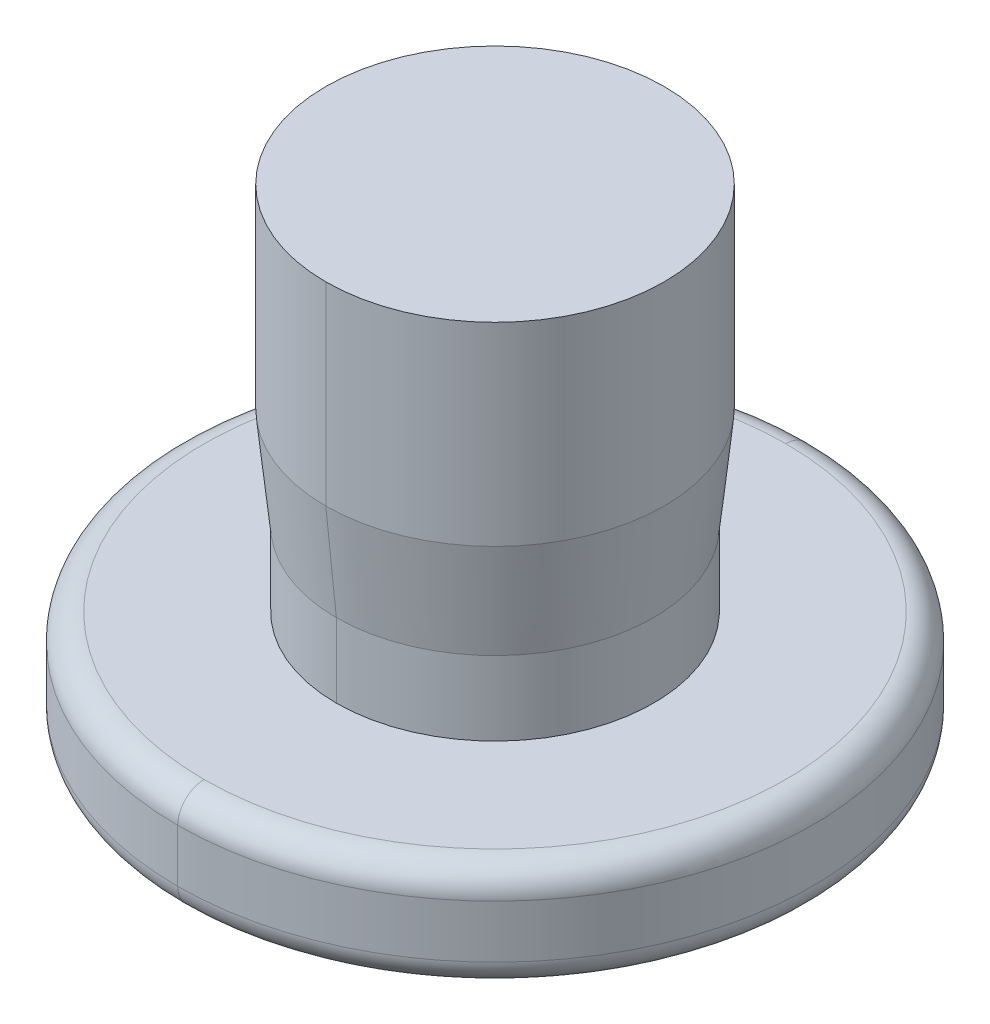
ISO-10303-21;
HEADER;
FILE_DESCRIPTION(('STEP AP214'),'2;1');
FILE_NAME('part.step','',(''),(''),'','','');
FILE_SCHEMA(('AUTOMOTIVE_DESIGN { 1 0 10303 214 1 1 1 1 }'));
ENDSEC;
DATA;
#1=APPLICATION_CONTEXT('core data for automotive mechanical design processes');
#2=APPLICATION_PROTOCOL_DEFINITION('international standard','automotive_design',2000,#1);
#3=PRODUCT_CONTEXT('',#1,'mechanical');
#4=PRODUCT('Part','Part','',(#3));
#5=PRODUCT_RELATED_PRODUCT_CATEGORY('part','',(#4));
#6=PRODUCT_DEFINITION_FORMATION('','',#4);
#7=PRODUCT_DEFINITION_CONTEXT('part definition',#1,'design');
#8=PRODUCT_DEFINITION('design','',#6,#7);
#9=PRODUCT_DEFINITION_SHAPE('','',#8);
#10=(LENGTH_UNIT() NAMED_UNIT(*) SI_UNIT(.MILLI.,.METRE.));
#11=(NAMED_UNIT(*) PLANE_ANGLE_UNIT() SI_UNIT($,.RADIAN.));
#12=(NAMED_UNIT(*) SI_UNIT($,.STERADIAN.) SOLID_ANGLE_UNIT());
#13=UNCERTAINTY_MEASURE_WITH_UNIT(LENGTH_MEASURE(1.E-05),#10,'distance_accuracy_value','');
#14=(GEOMETRIC_REPRESENTATION_CONTEXT(3) GLOBAL_UNCERTAINTY_ASSIGNED_CONTEXT((#13)) GLOBAL_UNIT_ASSIGNED_CONTEXT((#10,
#11,#12)) REPRESENTATION_CONTEXT('',''));
#15=CARTESIAN_POINT('',(0.,0.,0.));
#16=DIRECTION('',(0.,0.,1.));
#17=DIRECTION('',(1.,0.,0.));
#18=AXIS2_PLACEMENT_3D('',#15,#16,#17);
#19=CARTESIAN_POINT('',(36.4639094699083,-12.7939015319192,0.));
#20=DIRECTION('',(0.,-1.,0.));
#21=DIRECTION('',(0.,0.,-1.));
#22=AXIS2_PLACEMENT_3D('',#19,#20,#21);
#23=PLANE('',#22);
#24=CARTESIAN_POINT('',(36.4639094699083,-12.7939015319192,0.));
#25=DIRECTION('',(0.,-1.,0.));
#26=DIRECTION('',(0.,0.,-1.));
#27=AXIS2_PLACEMENT_3D('',#24,#25,#26);
#28=CIRCLE('',#27,1.);
#29=CARTESIAN_POINT('',(36.4639094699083,-12.7939015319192,-1.));
#30=VERTEX_POINT('',#29);
#31=CARTESIAN_POINT('',(36.4639094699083,-12.7939015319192,1.));
#32=VERTEX_POINT('',#31);
#33=EDGE_CURVE('E10',#30,#32,#28,.T.);
#34=ORIENTED_EDGE('',*,*,#33,.T.);
#35=CARTESIAN_POINT('',(36.4639094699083,-12.7939015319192,0.));
#36=DIRECTION('',(0.,-1.,0.));
#37=DIRECTION('',(0.,0.,-1.));
#38=AXIS2_PLACEMENT_3D('',#35,#36,#37);
#39=CIRCLE('',#38,1.);
#40=EDGE_CURVE('E112',#32,#30,#39,.T.);
#41=ORIENTED_EDGE('',*,*,#40,.T.);
#42=EDGE_LOOP('',(#34,#41));
#43=FACE_BOUND('',#42,.T.);
#44=ADVANCED_FACE('F15',(#43),#23,.T.);
#45=CARTESIAN_POINT('',(36.4639094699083,-12.7939015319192,0.));
#46=DIRECTION('',(0.,-1.,0.));
#47=DIRECTION('',(0.,0.,-1.));
#48=AXIS2_PLACEMENT_3D('',#45,#46,#47);
#49=CYLINDRICAL_SURFACE('',#48,1.);
#50=DIRECTION('',(0.,-1.,0.));
#51=VECTOR('',#50,1.);
#52=CARTESIAN_POINT('',(36.4639094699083,-12.7939015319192,1.));
#53=LINE('',#52,#51);
#54=CARTESIAN_POINT('',(36.4639094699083,-13.7939015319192,1.));
#55=VERTEX_POINT('',#54);
#56=EDGE_CURVE('E117',#32,#55,#53,.T.);
#57=ORIENTED_EDGE('',*,*,#56,.F.);
#58=ORIENTED_EDGE('',*,*,#33,.F.);
#59=DIRECTION('',(0.,-1.,0.));
#60=VECTOR('',#59,1.);
#61=CARTESIAN_POINT('',(36.4639094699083,-12.7939015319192,-1.));
#62=LINE('',#61,#60);
#63=CARTESIAN_POINT('',(36.4639094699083,-13.7939015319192,-1.));
#64=VERTEX_POINT('',#63);
#65=EDGE_CURVE('E127',#30,#64,#62,.T.);
#66=ORIENTED_EDGE('',*,*,#65,.T.);
#67=CARTESIAN_POINT('',(36.4639094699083,-13.7939015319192,0.));
#68=DIRECTION('',(0.,-1.,0.));
#69=DIRECTION('',(0.,0.,-1.));
#70=AXIS2_PLACEMENT_3D('',#67,#68,#69);
#71=CIRCLE('',#70,1.);
#72=EDGE_CURVE('E119',#64,#55,#71,.T.);
#73=ORIENTED_EDGE('',*,*,#72,.T.);
#74=EDGE_LOOP('',(#57,#58,#66,#73));
#75=FACE_BOUND('',#74,.T.);
#76=ADVANCED_FACE('F118',(#75),#49,.F.);
#77=CARTESIAN_POINT('',(36.4639094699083,-13.0439015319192,0.));
#78=DIRECTION('',(0.,1.,0.));
#79=DIRECTION('',(0.,0.,1.));
#80=AXIS2_PLACEMENT_3D('',#77,#78,#79);
#81=TOROIDAL_SURFACE('',#80,2.75,0.25);
#82=CARTESIAN_POINT('',(36.4639094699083,-13.0439015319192,-2.75));
#83=DIRECTION('',(1.,0.,0.));
#84=DIRECTION('',(0.,0.,-1.));
#85=AXIS2_PLACEMENT_3D('',#82,#83,#84);
#86=CIRCLE('',#85,0.25);
#87=CARTESIAN_POINT('',(36.4639094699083,-13.0439015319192,-3.));
#88=VERTEX_POINT('',#87);
#89=CARTESIAN_POINT('',(36.4639094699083,-12.7939015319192,-2.75));
#90=VERTEX_POINT('',#89);
#91=EDGE_CURVE('E153',#88,#90,#86,.T.);
#92=ORIENTED_EDGE('',*,*,#91,.F.);
#93=CARTESIAN_POINT('',(36.4639094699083,-13.0439015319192,0.));
#94=DIRECTION('',(0.,-1.,0.));
#95=DIRECTION('',(0.,0.,1.));
#96=AXIS2_PLACEMENT_3D('',#93,#94,#95);
#97=CIRCLE('',#96,3.);
#98=CARTESIAN_POINT('',(36.4639094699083,-13.0439015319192,3.));
#99=VERTEX_POINT('',#98);
#100=EDGE_CURVE('E222',#99,#88,#97,.T.);
#101=ORIENTED_EDGE('',*,*,#100,.F.);
#102=CARTESIAN_POINT('',(36.4639094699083,-13.0439015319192,2.75));
#103=DIRECTION('',(-1.,0.,0.));
#104=DIRECTION('',(0.,-1.,0.));
#105=AXIS2_PLACEMENT_3D('',#102,#103,#104);
#106=CIRCLE('',#105,0.25);
#107=CARTESIAN_POINT('',(36.4639094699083,-12.7939015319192,2.75));
#108=VERTEX_POINT('',#107);
#109=EDGE_CURVE('E167',#99,#108,#106,.T.);
#110=ORIENTED_EDGE('',*,*,#109,.T.);
#111=CARTESIAN_POINT('',(36.4639094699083,-12.7939015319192,0.));
#112=DIRECTION('',(0.,1.,0.));
#113=DIRECTION('',(0.,0.,1.));
#114=AXIS2_PLACEMENT_3D('',#111,#112,#113);
#115=CIRCLE('',#114,2.75);
#116=EDGE_CURVE('E228',#90,#108,#115,.T.);
#117=ORIENTED_EDGE('',*,*,#116,.F.);
#118=EDGE_LOOP('',(#92,#101,#110,#117));
#119=FACE_BOUND('',#118,.T.);
#120=ADVANCED_FACE('F255',(#119),#81,.T.);
#121=CARTESIAN_POINT('',(36.4639094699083,-13.5439015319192,0.));
#122=DIRECTION('',(0.,-1.,0.));
#123=DIRECTION('',(0.,0.,-1.));
#124=AXIS2_PLACEMENT_3D('',#121,#122,#123);
#125=TOROIDAL_SURFACE('',#124,2.75,0.25);
#126=CARTESIAN_POINT('',(36.4639094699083,-13.5439015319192,2.75));
#127=DIRECTION('',(1.,0.,0.));
#128=DIRECTION('',(0.,0.,-1.));
#129=AXIS2_PLACEMENT_3D('',#126,#127,#128);
#130=CIRCLE('',#129,0.25);
#131=CARTESIAN_POINT('',(36.4639094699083,-13.5439015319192,3.));
#132=VERTEX_POINT('',#131);
#133=CARTESIAN_POINT('',(36.4639094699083,-13.7939015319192,2.75));
#134=VERTEX_POINT('',#133);
#135=EDGE_CURVE('E131',#132,#134,#130,.T.);
#136=ORIENTED_EDGE('',*,*,#135,.F.);
#137=CARTESIAN_POINT('',(36.4639094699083,-13.5439015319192,0.));
#138=DIRECTION('',(0.,1.,0.));
#139=DIRECTION('',(0.,0.,-1.));
#140=AXIS2_PLACEMENT_3D('',#137,#138,#139);
#141=CIRCLE('',#140,3.);
#142=CARTESIAN_POINT('',(36.4639094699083,-13.5439015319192,-3.));
#143=VERTEX_POINT('',#142);
#144=EDGE_CURVE('E225',#143,#132,#141,.T.);
#145=ORIENTED_EDGE('',*,*,#144,.F.);
#146=CARTESIAN_POINT('',(36.4639094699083,-13.5439015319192,-2.75));
#147=DIRECTION('',(-1.,0.,0.));
#148=DIRECTION('',(0.,-1.,0.));
#149=AXIS2_PLACEMENT_3D('',#146,#147,#148);
#150=CIRCLE('',#149,0.25);
#151=CARTESIAN_POINT('',(36.4639094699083,-13.7939015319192,-2.75));
#152=VERTEX_POINT('',#151);
#153=EDGE_CURVE('E146',#143,#152,#150,.T.);
#154=ORIENTED_EDGE('',*,*,#153,.T.);
#155=CARTESIAN_POINT('',(36.4639094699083,-13.7939015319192,0.));
#156=DIRECTION('',(0.,-1.,0.));
#157=DIRECTION('',(0.,0.,-1.));
#158=AXIS2_PLACEMENT_3D('',#155,#156,#157);
#159=CIRCLE('',#158,2.75);
#160=EDGE_CURVE('E217',#134,#152,#159,.T.);
#161=ORIENTED_EDGE('',*,*,#160,.F.);
#162=EDGE_LOOP('',(#136,#145,#154,#161));
#163=FACE_BOUND('',#162,.T.);
#164=ADVANCED_FACE('F246',(#163),#125,.T.);
#165=CARTESIAN_POINT('',(38.0639094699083,-9.29390153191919,0.));
#166=DIRECTION('',(0.,1.,0.));
#167=DIRECTION('',(0.,0.,-1.));
#168=AXIS2_PLACEMENT_3D('',#165,#166,#167);
#169=PLANE('',#168);
#170=CARTESIAN_POINT('',(36.4639094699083,-9.29390153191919,0.));
#171=DIRECTION('',(0.,-1.,0.));
#172=DIRECTION('',(0.,0.,-1.));
#173=AXIS2_PLACEMENT_3D('',#170,#171,#172);
#174=CIRCLE('',#173,1.6);
#175=CARTESIAN_POINT('',(36.4639094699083,-9.29390153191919,-1.6));
#176=VERTEX_POINT('',#175);
#177=CARTESIAN_POINT('',(36.4639094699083,-9.29390153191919,1.6));
#178=VERTEX_POINT('',#177);
#179=EDGE_CURVE('E163',#176,#178,#174,.T.);
#180=ORIENTED_EDGE('',*,*,#179,.F.);
#181=CARTESIAN_POINT('',(36.4639094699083,-9.29390153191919,0.));
#182=DIRECTION('',(0.,-1.,0.));
#183=DIRECTION('',(0.,0.,-1.));
#184=AXIS2_PLACEMENT_3D('',#181,#182,#183);
#185=CIRCLE('',#184,1.6);
#186=EDGE_CURVE('E23',#178,#176,#185,.T.);
#187=ORIENTED_EDGE('',*,*,#186,.F.);
#188=EDGE_LOOP('',(#180,#187));
#189=FACE_BOUND('',#188,.T.);
#190=ADVANCED_FACE('F244',(#189),#169,.T.);
#191=CARTESIAN_POINT('',(36.4639094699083,-13.7939015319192,0.));
#192=DIRECTION('',(0.,-1.,0.));
#193=DIRECTION('',(0.,0.,-1.));
#194=AXIS2_PLACEMENT_3D('',#191,#192,#193);
#195=CYLINDRICAL_SURFACE('',#194,1.6);
#196=DIRECTION('',(0.,-1.,0.));
#197=VECTOR('',#196,1.);
#198=CARTESIAN_POINT('',(36.4639094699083,-13.7939015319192,1.6));
#199=LINE('',#198,#197);
#200=CARTESIAN_POINT('',(36.4639094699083,-11.1293304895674,1.6));
#201=VERTEX_POINT('',#200);
#202=EDGE_CURVE('E158',#178,#201,#199,.T.);
#203=ORIENTED_EDGE('',*,*,#202,.F.);
#204=ORIENTED_EDGE('',*,*,#186,.T.);
#205=DIRECTION('',(0.,-1.,0.));
#206=VECTOR('',#205,1.);
#207=CARTESIAN_POINT('',(36.4639094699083,-13.7939015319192,-1.6));
#208=LINE('',#207,#206);
#209=CARTESIAN_POINT('',(36.4639094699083,-11.1293304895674,-1.6));
#210=VERTEX_POINT('',#209);
#211=EDGE_CURVE('E171',#176,#210,#208,.T.);
#212=ORIENTED_EDGE('',*,*,#211,.T.);
#213=CARTESIAN_POINT('',(36.4639094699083,-11.1293304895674,0.));
#214=DIRECTION('',(0.,-1.,0.));
#215=DIRECTION('',(0.,0.,-1.));
#216=AXIS2_PLACEMENT_3D('',#213,#214,#215);
#217=CIRCLE('',#216,1.6);
#218=EDGE_CURVE('E137',#201,#210,#217,.T.);
#219=ORIENTED_EDGE('',*,*,#218,.F.);
#220=EDGE_LOOP('',(#203,#204,#212,#219));
#221=FACE_BOUND('',#220,.T.);
#222=ADVANCED_FACE('F238',(#221),#195,.T.);
#223=CARTESIAN_POINT('',(36.4639094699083,-12.0939015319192,0.));
#224=DIRECTION('',(0.,1.,0.));
#225=DIRECTION('',(0.,0.,1.));
#226=AXIS2_PLACEMENT_3D('',#223,#224,#225);
#227=CONICAL_SURFACE('',#226,1.5,0.103303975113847);
#228=DIRECTION('',(0.,0.994668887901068,-0.103120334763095));
#229=VECTOR('',#228,1.);
#230=CARTESIAN_POINT('',(36.4639094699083,-12.0939015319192,-1.5));
#231=LINE('',#230,#229);
#232=CARTESIAN_POINT('',(36.4639094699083,-12.0939015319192,-1.5));
#233=VERTEX_POINT('',#232);
#234=EDGE_CURVE('E191',#233,#210,#231,.T.);
#235=ORIENTED_EDGE('',*,*,#234,.F.);
#236=CARTESIAN_POINT('',(36.4639094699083,-12.0939015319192,0.));
#237=DIRECTION('',(0.,-1.,0.));
#238=DIRECTION('',(0.,0.,-1.));
#239=AXIS2_PLACEMENT_3D('',#236,#237,#238);
#240=CIRCLE('',#239,1.5);
#241=CARTESIAN_POINT('',(36.4639094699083,-12.0939015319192,1.5));
#242=VERTEX_POINT('',#241);
#243=EDGE_CURVE('E140',#242,#233,#240,.T.);
#244=ORIENTED_EDGE('',*,*,#243,.F.);
#245=DIRECTION('',(0.,0.994668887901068,0.103120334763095));
#246=VECTOR('',#245,1.);
#247=CARTESIAN_POINT('',(36.4639094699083,-12.0939015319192,1.5));
#248=LINE('',#247,#246);
#249=EDGE_CURVE('E195',#242,#201,#248,.T.);
#250=ORIENTED_EDGE('',*,*,#249,.T.);
#251=ORIENTED_EDGE('',*,*,#218,.T.);
#252=EDGE_LOOP('',(#235,#244,#250,#251));
#253=FACE_BOUND('',#252,.T.);
#254=ADVANCED_FACE('F253',(#253),#227,.T.);
#255=CARTESIAN_POINT('',(36.4639094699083,-13.7939015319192,0.));
#256=DIRECTION('',(0.,-1.,0.));
#257=DIRECTION('',(0.,0.,-1.));
#258=AXIS2_PLACEMENT_3D('',#255,#256,#257);
#259=CYLINDRICAL_SURFACE('',#258,1.5);
#260=DIRECTION('',(0.,-1.,0.));
#261=VECTOR('',#260,1.);
#262=CARTESIAN_POINT('',(36.4639094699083,-13.7939015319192,1.5));
#263=LINE('',#262,#261);
#264=CARTESIAN_POINT('',(36.4639094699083,-12.7939015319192,1.5));
#265=VERTEX_POINT('',#264);
#266=EDGE_CURVE('E199',#242,#265,#263,.T.);
#267=ORIENTED_EDGE('',*,*,#266,.F.);
#268=ORIENTED_EDGE('',*,*,#243,.T.);
#269=DIRECTION('',(0.,-1.,0.));
#270=VECTOR('',#269,1.);
#271=CARTESIAN_POINT('',(36.4639094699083,-13.7939015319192,-1.5));
#272=LINE('',#271,#270);
#273=CARTESIAN_POINT('',(36.4639094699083,-12.7939015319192,-1.5));
#274=VERTEX_POINT('',#273);
#275=EDGE_CURVE('E206',#233,#274,#272,.T.);
#276=ORIENTED_EDGE('',*,*,#275,.T.);
#277=CARTESIAN_POINT('',(36.4639094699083,-12.7939015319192,0.));
#278=DIRECTION('',(0.,-1.,0.));
#279=DIRECTION('',(0.,0.,-1.));
#280=AXIS2_PLACEMENT_3D('',#277,#278,#279);
#281=CIRCLE('',#280,1.5);
#282=EDGE_CURVE('E32',#265,#274,#281,.T.);
#283=ORIENTED_EDGE('',*,*,#282,.F.);
#284=EDGE_LOOP('',(#267,#268,#276,#283));
#285=FACE_BOUND('',#284,.T.);
#286=ADVANCED_FACE('F272',(#285),#259,.T.);
#287=CARTESIAN_POINT('',(39.4639094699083,-12.7939015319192,0.));
#288=DIRECTION('',(0.,1.,0.));
#289=DIRECTION('',(0.,0.,-1.));
#290=AXIS2_PLACEMENT_3D('',#287,#288,#289);
#291=PLANE('',#290);
#292=CARTESIAN_POINT('',(36.4639094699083,-12.7939015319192,0.));
#293=DIRECTION('',(0.,-1.,0.));
#294=DIRECTION('',(0.,0.,-1.));
#295=AXIS2_PLACEMENT_3D('',#292,#293,#294);
#296=CIRCLE('',#295,1.5);
#297=EDGE_CURVE('E203',#274,#265,#296,.T.);
#298=ORIENTED_EDGE('',*,*,#297,.T.);
#299=ORIENTED_EDGE('',*,*,#282,.T.);
#300=EDGE_LOOP('',(#298,#299));
#301=FACE_BOUND('',#300,.T.);
#302=CARTESIAN_POINT('',(36.4639094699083,-12.7939015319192,0.));
#303=DIRECTION('',(0.,1.,0.));
#304=DIRECTION('',(0.,0.,1.));
#305=AXIS2_PLACEMENT_3D('',#302,#303,#304);
#306=CIRCLE('',#305,2.75);
#307=EDGE_CURVE('E157',#108,#90,#306,.T.);
#308=ORIENTED_EDGE('',*,*,#307,.T.);
#309=ORIENTED_EDGE('',*,*,#116,.T.);
#310=EDGE_LOOP('',(#308,#309));
#311=FACE_BOUND('',#310,.T.);
#312=ADVANCED_FACE('F274',(#301,#311),#291,.T.);
#313=CARTESIAN_POINT('',(36.4639094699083,-13.7939015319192,0.));
#314=DIRECTION('',(0.,-1.,0.));
#315=DIRECTION('',(0.,0.,-1.));
#316=AXIS2_PLACEMENT_3D('',#313,#314,#315);
#317=CYLINDRICAL_SURFACE('',#316,3.);
#318=DIRECTION('',(0.,-1.,0.));
#319=VECTOR('',#318,1.);
#320=CARTESIAN_POINT('',(36.4639094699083,-13.7939015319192,3.));
#321=LINE('',#320,#319);
#322=EDGE_CURVE('E209',#99,#132,#321,.T.);
#323=ORIENTED_EDGE('',*,*,#322,.F.);
#324=ORIENTED_EDGE('',*,*,#100,.T.);
#325=DIRECTION('',(0.,-1.,0.));
#326=VECTOR('',#325,1.);
#327=CARTESIAN_POINT('',(36.4639094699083,-13.7939015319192,-3.));
#328=LINE('',#327,#326);
#329=EDGE_CURVE('E213',#88,#143,#328,.T.);
#330=ORIENTED_EDGE('',*,*,#329,.T.);
#331=ORIENTED_EDGE('',*,*,#144,.T.);
#332=EDGE_LOOP('',(#323,#324,#330,#331));
#333=FACE_BOUND('',#332,.T.);
#334=ADVANCED_FACE('F276',(#333),#317,.T.);
#335=CARTESIAN_POINT('',(36.4639094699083,-13.7939015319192,0.));
#336=DIRECTION('',(0.,-1.,0.));
#337=DIRECTION('',(0.,0.,-1.));
#338=AXIS2_PLACEMENT_3D('',#335,#336,#337);
#339=PLANE('',#338);
#340=ORIENTED_EDGE('',*,*,#72,.F.);
#341=CARTESIAN_POINT('',(36.4639094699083,-13.7939015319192,0.));
#342=DIRECTION('',(0.,-1.,0.));
#343=DIRECTION('',(0.,0.,-1.));
#344=AXIS2_PLACEMENT_3D('',#341,#342,#343);
#345=CIRCLE('',#344,1.);
#346=EDGE_CURVE('E124',#55,#64,#345,.T.);
#347=ORIENTED_EDGE('',*,*,#346,.F.);
#348=EDGE_LOOP('',(#340,#347));
#349=FACE_BOUND('',#348,.T.);
#350=CARTESIAN_POINT('',(36.4639094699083,-13.7939015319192,0.));
#351=DIRECTION('',(0.,-1.,0.));
#352=DIRECTION('',(0.,0.,-1.));
#353=AXIS2_PLACEMENT_3D('',#350,#351,#352);
#354=CIRCLE('',#353,2.75);
#355=EDGE_CURVE('E135',#152,#134,#354,.T.);
#356=ORIENTED_EDGE('',*,*,#355,.T.);
#357=ORIENTED_EDGE('',*,*,#160,.T.);
#358=EDGE_LOOP('',(#356,#357));
#359=FACE_BOUND('',#358,.T.);
#360=ADVANCED_FACE('F278',(#349,#359),#339,.T.);
#361=CARTESIAN_POINT('',(36.4639094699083,-13.7939015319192,0.));
#362=DIRECTION('',(0.,-1.,0.));
#363=DIRECTION('',(0.,0.,-1.));
#364=AXIS2_PLACEMENT_3D('',#361,#362,#363);
#365=CYLINDRICAL_SURFACE('',#364,3.);
#366=CARTESIAN_POINT('',(36.4639094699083,-13.0439015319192,0.));
#367=DIRECTION('',(0.,-1.,0.));
#368=DIRECTION('',(0.,0.,1.));
#369=AXIS2_PLACEMENT_3D('',#366,#367,#368);
#370=CIRCLE('',#369,3.);
#371=EDGE_CURVE('E149',#88,#99,#370,.T.);
#372=ORIENTED_EDGE('',*,*,#371,.T.);
#373=ORIENTED_EDGE('',*,*,#322,.T.);
#374=CARTESIAN_POINT('',(36.4639094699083,-13.5439015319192,0.));
#375=DIRECTION('',(0.,1.,0.));
#376=DIRECTION('',(0.,0.,-1.));
#377=AXIS2_PLACEMENT_3D('',#374,#375,#376);
#378=CIRCLE('',#377,3.);
#379=EDGE_CURVE('E136',#132,#143,#378,.T.);
#380=ORIENTED_EDGE('',*,*,#379,.T.);
#381=ORIENTED_EDGE('',*,*,#329,.F.);
#382=EDGE_LOOP('',(#372,#373,#380,#381));
#383=FACE_BOUND('',#382,.T.);
#384=ADVANCED_FACE('F283',(#383),#365,.T.);
#385=CARTESIAN_POINT('',(36.4639094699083,-13.7939015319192,0.));
#386=DIRECTION('',(0.,-1.,0.));
#387=DIRECTION('',(0.,0.,-1.));
#388=AXIS2_PLACEMENT_3D('',#385,#386,#387);
#389=CYLINDRICAL_SURFACE('',#388,1.5);
#390=CARTESIAN_POINT('',(36.4639094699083,-12.0939015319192,0.));
#391=DIRECTION('',(0.,-1.,0.));
#392=DIRECTION('',(0.,0.,-1.));
#393=AXIS2_PLACEMENT_3D('',#390,#391,#392);
#394=CIRCLE('',#393,1.5);
#395=EDGE_CURVE('E187',#233,#242,#394,.T.);
#396=ORIENTED_EDGE('',*,*,#395,.T.);
#397=ORIENTED_EDGE('',*,*,#266,.T.);
#398=ORIENTED_EDGE('',*,*,#297,.F.);
#399=ORIENTED_EDGE('',*,*,#275,.F.);
#400=EDGE_LOOP('',(#396,#397,#398,#399));
#401=FACE_BOUND('',#400,.T.);
#402=ADVANCED_FACE('F314',(#401),#389,.T.);
#403=CARTESIAN_POINT('',(36.4639094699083,-12.0939015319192,0.));
#404=DIRECTION('',(0.,1.,0.));
#405=DIRECTION('',(0.,0.,1.));
#406=AXIS2_PLACEMENT_3D('',#403,#404,#405);
#407=CONICAL_SURFACE('',#406,1.5,0.103303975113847);
#408=ORIENTED_EDGE('',*,*,#395,.F.);
#409=ORIENTED_EDGE('',*,*,#234,.T.);
#410=CARTESIAN_POINT('',(36.4639094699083,-11.1293304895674,0.));
#411=DIRECTION('',(0.,-1.,0.));
#412=DIRECTION('',(0.,0.,-1.));
#413=AXIS2_PLACEMENT_3D('',#410,#411,#412);
#414=CIRCLE('',#413,1.6);
#415=EDGE_CURVE('E162',#210,#201,#414,.T.);
#416=ORIENTED_EDGE('',*,*,#415,.T.);
#417=ORIENTED_EDGE('',*,*,#249,.F.);
#418=EDGE_LOOP('',(#408,#409,#416,#417));
#419=FACE_BOUND('',#418,.T.);
#420=ADVANCED_FACE('F309',(#419),#407,.T.);
#421=CARTESIAN_POINT('',(36.4639094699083,-13.7939015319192,0.));
#422=DIRECTION('',(0.,-1.,0.));
#423=DIRECTION('',(0.,0.,-1.));
#424=AXIS2_PLACEMENT_3D('',#421,#422,#423);
#425=CYLINDRICAL_SURFACE('',#424,1.6);
#426=ORIENTED_EDGE('',*,*,#179,.T.);
#427=ORIENTED_EDGE('',*,*,#202,.T.);
#428=ORIENTED_EDGE('',*,*,#415,.F.);
#429=ORIENTED_EDGE('',*,*,#211,.F.);
#430=EDGE_LOOP('',(#426,#427,#428,#429));
#431=FACE_BOUND('',#430,.T.);
#432=ADVANCED_FACE('F243',(#431),#425,.T.);
#433=CARTESIAN_POINT('',(36.4639094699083,-13.5439015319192,0.));
#434=DIRECTION('',(0.,-1.,0.));
#435=DIRECTION('',(0.,0.,-1.));
#436=AXIS2_PLACEMENT_3D('',#433,#434,#435);
#437=TOROIDAL_SURFACE('',#436,2.75,0.25);
#438=ORIENTED_EDGE('',*,*,#379,.F.);
#439=ORIENTED_EDGE('',*,*,#135,.T.);
#440=ORIENTED_EDGE('',*,*,#355,.F.);
#441=ORIENTED_EDGE('',*,*,#153,.F.);
#442=EDGE_LOOP('',(#438,#439,#440,#441));
#443=FACE_BOUND('',#442,.T.);
#444=ADVANCED_FACE('F300',(#443),#437,.T.);
#445=CARTESIAN_POINT('',(36.4639094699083,-13.0439015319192,0.));
#446=DIRECTION('',(0.,1.,0.));
#447=DIRECTION('',(0.,0.,1.));
#448=AXIS2_PLACEMENT_3D('',#445,#446,#447);
#449=TOROIDAL_SURFACE('',#448,2.75,0.25);
#450=ORIENTED_EDGE('',*,*,#371,.F.);
#451=ORIENTED_EDGE('',*,*,#91,.T.);
#452=ORIENTED_EDGE('',*,*,#307,.F.);
#453=ORIENTED_EDGE('',*,*,#109,.F.);
#454=EDGE_LOOP('',(#450,#451,#452,#453));
#455=FACE_BOUND('',#454,.T.);
#456=ADVANCED_FACE('F293',(#455),#449,.T.);
#457=CARTESIAN_POINT('',(36.4639094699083,-12.7939015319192,0.));
#458=DIRECTION('',(0.,-1.,0.));
#459=DIRECTION('',(0.,0.,-1.));
#460=AXIS2_PLACEMENT_3D('',#457,#458,#459);
#461=CYLINDRICAL_SURFACE('',#460,1.);
#462=ORIENTED_EDGE('',*,*,#40,.F.);
#463=ORIENTED_EDGE('',*,*,#56,.T.);
#464=ORIENTED_EDGE('',*,*,#346,.T.);
#465=ORIENTED_EDGE('',*,*,#65,.F.);
#466=EDGE_LOOP('',(#462,#463,#464,#465));
#467=FACE_BOUND('',#466,.T.);
#468=ADVANCED_FACE('F126',(#467),#461,.F.);
#469=CLOSED_SHELL('',(#44,#76,#120,#164,#190,#222,#254,#286,#312,#334,#360,#384,#402,#420,#432,
#444,#456,#468));
#470=MANIFOLD_SOLID_BREP('B1',#469);
#471=ADVANCED_BREP_SHAPE_REPRESENTATION('',(#18,#470),#14);
#472=SHAPE_DEFINITION_REPRESENTATION(#9,#471);
ENDSEC;
END-ISO-10303-21;
